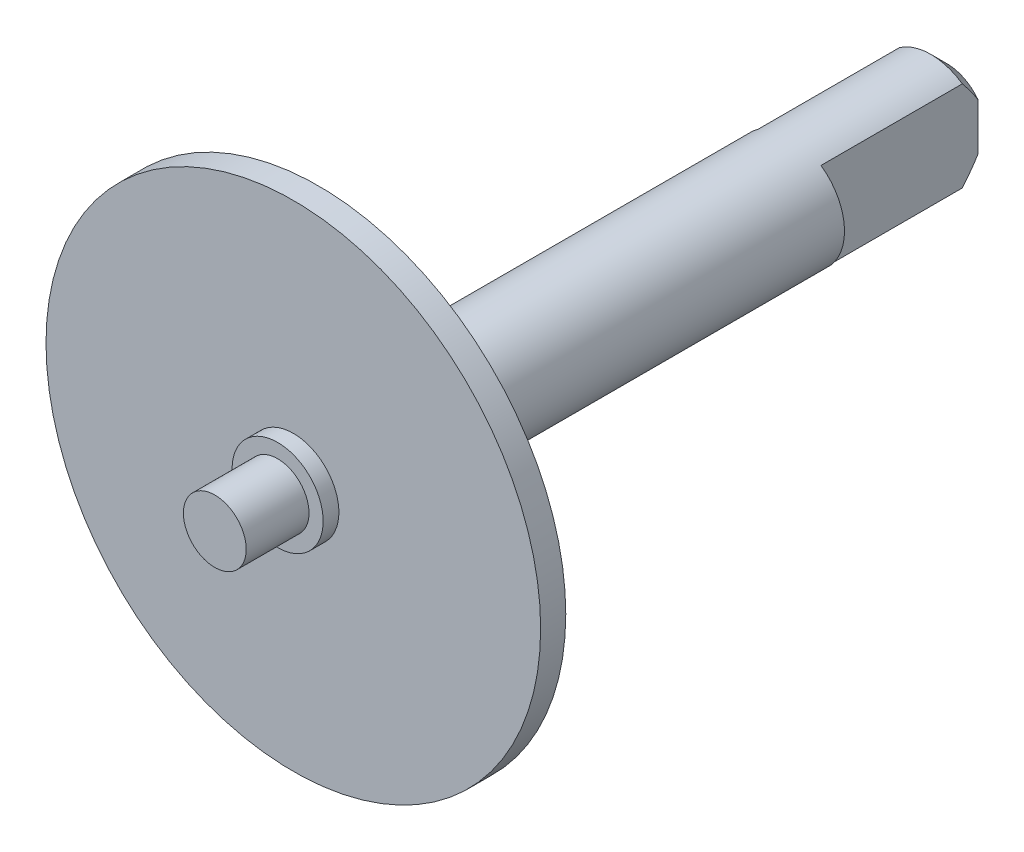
ISO-10303-21;
HEADER;
FILE_DESCRIPTION(('STEP AP214'),'2;1');
FILE_NAME('part.step','',(''),(''),'','','');
FILE_SCHEMA(('AUTOMOTIVE_DESIGN { 1 0 10303 214 1 1 1 1 }'));
ENDSEC;
DATA;
#1=APPLICATION_CONTEXT('core data for automotive mechanical design processes');
#2=APPLICATION_PROTOCOL_DEFINITION('international standard','automotive_design',2000,#1);
#3=PRODUCT_CONTEXT('',#1,'mechanical');
#4=PRODUCT('Part','Part','',(#3));
#5=PRODUCT_RELATED_PRODUCT_CATEGORY('part','',(#4));
#6=PRODUCT_DEFINITION_FORMATION('','',#4);
#7=PRODUCT_DEFINITION_CONTEXT('part definition',#1,'design');
#8=PRODUCT_DEFINITION('design','',#6,#7);
#9=PRODUCT_DEFINITION_SHAPE('','',#8);
#10=(LENGTH_UNIT() NAMED_UNIT(*) SI_UNIT(.MILLI.,.METRE.));
#11=(NAMED_UNIT(*) PLANE_ANGLE_UNIT() SI_UNIT($,.RADIAN.));
#12=(NAMED_UNIT(*) SI_UNIT($,.STERADIAN.) SOLID_ANGLE_UNIT());
#13=UNCERTAINTY_MEASURE_WITH_UNIT(LENGTH_MEASURE(1.E-05),#10,'distance_accuracy_value','');
#14=(GEOMETRIC_REPRESENTATION_CONTEXT(3) GLOBAL_UNCERTAINTY_ASSIGNED_CONTEXT((#13)) GLOBAL_UNIT_ASSIGNED_CONTEXT((#10,
#11,#12)) REPRESENTATION_CONTEXT('',''));
#15=CARTESIAN_POINT('',(0.,0.,0.));
#16=DIRECTION('',(0.,0.,1.));
#17=DIRECTION('',(1.,0.,0.));
#18=AXIS2_PLACEMENT_3D('',#15,#16,#17);
#19=CARTESIAN_POINT('',(10.,0.,-15.));
#20=DIRECTION('',(0.,0.,1.));
#21=DIRECTION('',(1.,0.,0.));
#22=AXIS2_PLACEMENT_3D('',#19,#20,#21);
#23=CYLINDRICAL_SURFACE('',#22,1.75);
#24=CARTESIAN_POINT('',(10.,0.,2.5));
#25=DIRECTION('',(0.,0.,1.));
#26=DIRECTION('',(1.,0.,0.));
#27=AXIS2_PLACEMENT_3D('',#24,#25,#26);
#28=CIRCLE('',#27,1.75);
#29=CARTESIAN_POINT('',(11.75,0.,2.5));
#30=VERTEX_POINT('',#29);
#31=EDGE_CURVE('E127',#30,#30,#28,.T.);
#32=ORIENTED_EDGE('',*,*,#31,.F.);
#33=EDGE_LOOP('',(#32));
#34=FACE_BOUND('',#33,.T.);
#35=DIRECTION('',(0.,0.,1.));
#36=VECTOR('',#35,1.);
#37=CARTESIAN_POINT('',(9.00000000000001,-1.43614066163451,-15.));
#38=LINE('',#37,#36);
#39=CARTESIAN_POINT('',(9.00000000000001,-1.43614066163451,-10.));
#40=VERTEX_POINT('',#39);
#41=CARTESIAN_POINT('',(9.00000000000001,-1.43614066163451,-14.5));
#42=VERTEX_POINT('',#41);
#43=EDGE_CURVE('E125',#40,#42,#38,.F.);
#44=ORIENTED_EDGE('',*,*,#43,.T.);
#45=CARTESIAN_POINT('',(10.,0.,-14.5));
#46=DIRECTION('',(0.,0.,1.));
#47=DIRECTION('',(1.,0.,0.));
#48=AXIS2_PLACEMENT_3D('',#45,#46,#47);
#49=CIRCLE('',#48,1.75);
#50=CARTESIAN_POINT('',(11.,-1.43614066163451,-14.5));
#51=VERTEX_POINT('',#50);
#52=EDGE_CURVE('E134',#42,#51,#49,.T.);
#53=ORIENTED_EDGE('',*,*,#52,.T.);
#54=DIRECTION('',(0.,0.,1.));
#55=VECTOR('',#54,1.);
#56=CARTESIAN_POINT('',(11.,-1.43614066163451,-15.));
#57=LINE('',#56,#55);
#58=CARTESIAN_POINT('',(11.,-1.43614066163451,-10.));
#59=VERTEX_POINT('',#58);
#60=EDGE_CURVE('E95',#51,#59,#57,.T.);
#61=ORIENTED_EDGE('',*,*,#60,.T.);
#62=CARTESIAN_POINT('',(10.,0.,-10.));
#63=DIRECTION('',(0.,0.,-1.));
#64=DIRECTION('',(-1.,0.,0.));
#65=AXIS2_PLACEMENT_3D('',#62,#63,#64);
#66=CIRCLE('',#65,1.75);
#67=CARTESIAN_POINT('',(11.,1.43614066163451,-10.));
#68=VERTEX_POINT('',#67);
#69=EDGE_CURVE('E87',#59,#68,#66,.F.);
#70=ORIENTED_EDGE('',*,*,#69,.T.);
#71=DIRECTION('',(0.,0.,1.));
#72=VECTOR('',#71,1.);
#73=CARTESIAN_POINT('',(11.,1.43614066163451,-15.));
#74=LINE('',#73,#72);
#75=CARTESIAN_POINT('',(11.,1.43614066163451,-14.5));
#76=VERTEX_POINT('',#75);
#77=EDGE_CURVE('E91',#68,#76,#74,.F.);
#78=ORIENTED_EDGE('',*,*,#77,.T.);
#79=CARTESIAN_POINT('',(10.,0.,-14.5));
#80=DIRECTION('',(0.,0.,1.));
#81=DIRECTION('',(1.,0.,0.));
#82=AXIS2_PLACEMENT_3D('',#79,#80,#81);
#83=CIRCLE('',#82,1.75);
#84=CARTESIAN_POINT('',(9.00000000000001,1.43614066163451,-14.5));
#85=VERTEX_POINT('',#84);
#86=EDGE_CURVE('E132',#76,#85,#83,.T.);
#87=ORIENTED_EDGE('',*,*,#86,.T.);
#88=DIRECTION('',(0.,0.,1.));
#89=VECTOR('',#88,1.);
#90=CARTESIAN_POINT('',(9.00000000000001,1.43614066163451,-15.));
#91=LINE('',#90,#89);
#92=CARTESIAN_POINT('',(9.00000000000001,1.43614066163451,-10.));
#93=VERTEX_POINT('',#92);
#94=EDGE_CURVE('E108',#85,#93,#91,.T.);
#95=ORIENTED_EDGE('',*,*,#94,.T.);
#96=CARTESIAN_POINT('',(10.,0.,-10.));
#97=DIRECTION('',(0.,0.,-1.));
#98=DIRECTION('',(-1.,0.,0.));
#99=AXIS2_PLACEMENT_3D('',#96,#97,#98);
#100=CIRCLE('',#99,1.75);
#101=EDGE_CURVE('E99',#93,#40,#100,.F.);
#102=ORIENTED_EDGE('',*,*,#101,.T.);
#103=EDGE_LOOP('',(#44,#53,#61,#70,#78,#87,#95,#102));
#104=FACE_BOUND('',#103,.T.);
#105=ADVANCED_FACE('F31',(#34,#104),#23,.T.);
#106=CARTESIAN_POINT('',(10.,0.,-15.));
#107=DIRECTION('',(0.,0.,1.));
#108=DIRECTION('',(1.,0.,0.));
#109=AXIS2_PLACEMENT_3D('',#106,#107,#108);
#110=PLANE('',#109);
#111=DIRECTION('',(0.,1.,0.));
#112=VECTOR('',#111,1.);
#113=CARTESIAN_POINT('',(11.,0.,-15.));
#114=LINE('',#113,#112);
#115=CARTESIAN_POINT('',(11.,-0.749999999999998,-15.));
#116=VERTEX_POINT('',#115);
#117=CARTESIAN_POINT('',(11.,0.749999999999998,-15.));
#118=VERTEX_POINT('',#117);
#119=EDGE_CURVE('E121',#116,#118,#114,.T.);
#120=ORIENTED_EDGE('',*,*,#119,.F.);
#121=CARTESIAN_POINT('',(10.,0.,-15.));
#122=DIRECTION('',(0.,0.,1.));
#123=DIRECTION('',(1.,0.,0.));
#124=AXIS2_PLACEMENT_3D('',#121,#122,#123);
#125=CIRCLE('',#124,1.25);
#126=CARTESIAN_POINT('',(9.00000000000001,-0.749999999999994,-15.));
#127=VERTEX_POINT('',#126);
#128=EDGE_CURVE('E50',#116,#127,#125,.F.);
#129=ORIENTED_EDGE('',*,*,#128,.T.);
#130=DIRECTION('',(0.,-1.,0.));
#131=VECTOR('',#130,1.);
#132=CARTESIAN_POINT('',(9.00000000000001,22.7331668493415,-15.));
#133=LINE('',#132,#131);
#134=CARTESIAN_POINT('',(9.00000000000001,0.749999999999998,-15.));
#135=VERTEX_POINT('',#134);
#136=EDGE_CURVE('E100',#135,#127,#133,.T.);
#137=ORIENTED_EDGE('',*,*,#136,.F.);
#138=CARTESIAN_POINT('',(10.,0.,-15.));
#139=DIRECTION('',(0.,0.,1.));
#140=DIRECTION('',(1.,0.,0.));
#141=AXIS2_PLACEMENT_3D('',#138,#139,#140);
#142=CIRCLE('',#141,1.25);
#143=EDGE_CURVE('E179',#135,#118,#142,.F.);
#144=ORIENTED_EDGE('',*,*,#143,.T.);
#145=EDGE_LOOP('',(#120,#129,#137,#144));
#146=FACE_BOUND('',#145,.T.);
#147=ADVANCED_FACE('F171',(#146),#110,.F.);
#148=CARTESIAN_POINT('',(11.,22.7331668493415,-15.));
#149=DIRECTION('',(1.,0.,0.));
#150=DIRECTION('',(0.,0.,-1.));
#151=AXIS2_PLACEMENT_3D('',#148,#149,#150);
#152=PLANE('',#151);
#153=ORIENTED_EDGE('',*,*,#60,.F.);
#154=CARTESIAN_POINT('',(11.,-1.43614066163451,-14.5));
#155=CARTESIAN_POINT('',(11.,-1.38137120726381,-14.5449012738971));
#156=CARTESIAN_POINT('',(11.,-1.32622333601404,-14.589360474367));
#157=CARTESIAN_POINT('',(11.,-1.21491846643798,-14.676848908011));
#158=CARTESIAN_POINT('',(11.,-1.15876280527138,-14.7198798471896));
#159=CARTESIAN_POINT('',(11.,-1.04502076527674,-14.8041056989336));
#160=CARTESIAN_POINT('',(11.,-0.987433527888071,-14.8452994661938));
#161=CARTESIAN_POINT('',(11.,-0.899618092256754,-14.9050637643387));
#162=CARTESIAN_POINT('',(11.,-0.870088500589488,-14.9246589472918));
#163=CARTESIAN_POINT('',(11.,-0.810476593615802,-14.9630051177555));
#164=CARTESIAN_POINT('',(11.,-0.780394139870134,-14.9817558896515));
#165=CARTESIAN_POINT('',(11.,-0.749999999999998,-15.));
#166=B_SPLINE_CURVE_WITH_KNOTS('',3,(#154,#155,#156,#157,#158,#159,#160,#161,#162,#163,#164,
#165),.UNSPECIFIED.,.F.,.F.,(4,2,2,2,2,4),(0.,0.212482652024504,0.424701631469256,
0.63705111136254,0.743357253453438,0.849690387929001),.UNSPECIFIED.);
#167=EDGE_CURVE('E142',#51,#116,#166,.T.);
#168=ORIENTED_EDGE('',*,*,#167,.T.);
#169=ORIENTED_EDGE('',*,*,#119,.T.);
#170=CARTESIAN_POINT('',(11.,0.749999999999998,-15.));
#171=CARTESIAN_POINT('',(11.,0.780394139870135,-14.9817558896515));
#172=CARTESIAN_POINT('',(11.,0.810476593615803,-14.9630051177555));
#173=CARTESIAN_POINT('',(11.,0.870088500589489,-14.9246589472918));
#174=CARTESIAN_POINT('',(11.,0.899618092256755,-14.9050637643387));
#175=CARTESIAN_POINT('',(11.,0.987433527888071,-14.8452994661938));
#176=CARTESIAN_POINT('',(11.,1.04502076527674,-14.8041056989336));
#177=CARTESIAN_POINT('',(11.,1.15876280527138,-14.7198798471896));
#178=CARTESIAN_POINT('',(11.,1.21491846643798,-14.676848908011));
#179=CARTESIAN_POINT('',(11.,1.32622333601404,-14.589360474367));
#180=CARTESIAN_POINT('',(11.,1.3813712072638,-14.5449012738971));
#181=CARTESIAN_POINT('',(11.,1.43614066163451,-14.5));
#182=B_SPLINE_CURVE_WITH_KNOTS('',3,(#170,#171,#172,#173,#174,#175,#176,#177,#178,#179,#180,
#181),.UNSPECIFIED.,.F.,.F.,(4,2,2,2,2,4),(0.,0.106333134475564,0.212639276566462,
0.424988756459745,0.637207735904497,0.849690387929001),.UNSPECIFIED.);
#183=EDGE_CURVE('E107',#118,#76,#182,.T.);
#184=ORIENTED_EDGE('',*,*,#183,.T.);
#185=ORIENTED_EDGE('',*,*,#77,.F.);
#186=DIRECTION('',(0.,-1.,0.));
#187=VECTOR('',#186,1.);
#188=CARTESIAN_POINT('',(11.,22.7331668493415,-10.));
#189=LINE('',#188,#187);
#190=EDGE_CURVE('E104',#68,#59,#189,.T.);
#191=ORIENTED_EDGE('',*,*,#190,.T.);
#192=EDGE_LOOP('',(#153,#168,#169,#184,#185,#191));
#193=FACE_BOUND('',#192,.T.);
#194=ADVANCED_FACE('F103',(#193),#152,.T.);
#195=CARTESIAN_POINT('',(11.,22.7331668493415,-10.));
#196=DIRECTION('',(0.,0.,-1.));
#197=DIRECTION('',(-1.,0.,0.));
#198=AXIS2_PLACEMENT_3D('',#195,#196,#197);
#199=PLANE('',#198);
#200=ORIENTED_EDGE('',*,*,#69,.F.);
#201=ORIENTED_EDGE('',*,*,#190,.F.);
#202=EDGE_LOOP('',(#200,#201));
#203=FACE_BOUND('',#202,.T.);
#204=ADVANCED_FACE('F110',(#203),#199,.T.);
#205=CARTESIAN_POINT('',(9.00000000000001,22.7331668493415,-10.));
#206=DIRECTION('',(0.,0.,-1.));
#207=DIRECTION('',(-1.,0.,0.));
#208=AXIS2_PLACEMENT_3D('',#205,#206,#207);
#209=PLANE('',#208);
#210=DIRECTION('',(0.,-1.,0.));
#211=VECTOR('',#210,1.);
#212=CARTESIAN_POINT('',(9.00000000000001,22.7331668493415,-10.));
#213=LINE('',#212,#211);
#214=EDGE_CURVE('E111',#93,#40,#213,.T.);
#215=ORIENTED_EDGE('',*,*,#214,.T.);
#216=ORIENTED_EDGE('',*,*,#101,.F.);
#217=EDGE_LOOP('',(#215,#216));
#218=FACE_BOUND('',#217,.T.);
#219=ADVANCED_FACE('F167',(#218),#209,.T.);
#220=CARTESIAN_POINT('',(9.00000000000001,22.7331668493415,-15.));
#221=DIRECTION('',(-1.,0.,0.));
#222=DIRECTION('',(0.,0.,1.));
#223=AXIS2_PLACEMENT_3D('',#220,#221,#222);
#224=PLANE('',#223);
#225=ORIENTED_EDGE('',*,*,#136,.T.);
#226=CARTESIAN_POINT('',(9.,-0.749999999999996,-15.));
#227=CARTESIAN_POINT('',(9.00000000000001,-0.780394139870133,-14.9817558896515));
#228=CARTESIAN_POINT('',(9.00000000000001,-0.810476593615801,-14.9630051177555));
#229=CARTESIAN_POINT('',(9.00000000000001,-0.870088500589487,-14.9246589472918));
#230=CARTESIAN_POINT('',(9.00000000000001,-0.899618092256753,-14.9050637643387));
#231=CARTESIAN_POINT('',(9.00000000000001,-0.98743352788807,-14.8452994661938));
#232=CARTESIAN_POINT('',(9.00000000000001,-1.04502076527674,-14.8041056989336));
#233=CARTESIAN_POINT('',(9.00000000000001,-1.15876280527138,-14.7198798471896));
#234=CARTESIAN_POINT('',(9.00000000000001,-1.21491846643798,-14.676848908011));
#235=CARTESIAN_POINT('',(9.00000000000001,-1.32622333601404,-14.589360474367));
#236=CARTESIAN_POINT('',(9.00000000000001,-1.38137120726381,-14.5449012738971));
#237=CARTESIAN_POINT('',(9.00000000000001,-1.43614066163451,-14.5));
#238=B_SPLINE_CURVE_WITH_KNOTS('',3,(#226,#227,#228,#229,#230,#231,#232,#233,#234,#235,#236,
#237),.UNSPECIFIED.,.F.,.F.,(4,2,2,2,2,4),(0.,0.106333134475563,0.212639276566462,
0.424988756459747,0.637207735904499,0.849690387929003),.UNSPECIFIED.);
#239=EDGE_CURVE('E11',#127,#42,#238,.T.);
#240=ORIENTED_EDGE('',*,*,#239,.T.);
#241=ORIENTED_EDGE('',*,*,#43,.F.);
#242=ORIENTED_EDGE('',*,*,#214,.F.);
#243=ORIENTED_EDGE('',*,*,#94,.F.);
#244=CARTESIAN_POINT('',(9.00000000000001,1.43614066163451,-14.5));
#245=CARTESIAN_POINT('',(9.00000000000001,1.38137120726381,-14.5449012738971));
#246=CARTESIAN_POINT('',(9.00000000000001,1.32622333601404,-14.589360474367));
#247=CARTESIAN_POINT('',(9.00000000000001,1.21491846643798,-14.676848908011));
#248=CARTESIAN_POINT('',(9.00000000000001,1.15876280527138,-14.7198798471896));
#249=CARTESIAN_POINT('',(9.00000000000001,1.04502076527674,-14.8041056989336));
#250=CARTESIAN_POINT('',(9.00000000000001,0.987433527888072,-14.8452994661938));
#251=CARTESIAN_POINT('',(9.00000000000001,0.899618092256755,-14.9050637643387));
#252=CARTESIAN_POINT('',(9.00000000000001,0.870088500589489,-14.9246589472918));
#253=CARTESIAN_POINT('',(9.00000000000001,0.810476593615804,-14.9630051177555));
#254=CARTESIAN_POINT('',(9.00000000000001,0.780394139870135,-14.9817558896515));
#255=CARTESIAN_POINT('',(9.00000000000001,0.749999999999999,-15.));
#256=B_SPLINE_CURVE_WITH_KNOTS('',3,(#244,#245,#246,#247,#248,#249,#250,#251,#252,#253,#254,
#255),.UNSPECIFIED.,.F.,.F.,(4,2,2,2,2,4),(0.,0.212482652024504,0.424701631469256,
0.637051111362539,0.743357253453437,0.849690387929),.UNSPECIFIED.);
#257=EDGE_CURVE('E43',#85,#135,#256,.T.);
#258=ORIENTED_EDGE('',*,*,#257,.T.);
#259=EDGE_LOOP('',(#225,#240,#241,#242,#243,#258));
#260=FACE_BOUND('',#259,.T.);
#261=ADVANCED_FACE('F163',(#260),#224,.T.);
#262=CARTESIAN_POINT('',(10.,0.,-14.5));
#263=DIRECTION('',(0.,0.,1.));
#264=DIRECTION('',(1.,0.,0.));
#265=AXIS2_PLACEMENT_3D('',#262,#263,#264);
#266=CONICAL_SURFACE('',#265,1.75,0.78539816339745);
#267=ORIENTED_EDGE('',*,*,#239,.F.);
#268=ORIENTED_EDGE('',*,*,#128,.F.);
#269=ORIENTED_EDGE('',*,*,#167,.F.);
#270=ORIENTED_EDGE('',*,*,#52,.F.);
#271=EDGE_LOOP('',(#267,#268,#269,#270));
#272=FACE_BOUND('',#271,.T.);
#273=ADVANCED_FACE('F154',(#272),#266,.T.);
#274=CARTESIAN_POINT('',(10.,0.,-14.5));
#275=DIRECTION('',(0.,0.,1.));
#276=DIRECTION('',(1.,0.,0.));
#277=AXIS2_PLACEMENT_3D('',#274,#275,#276);
#278=CONICAL_SURFACE('',#277,1.75,0.78539816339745);
#279=ORIENTED_EDGE('',*,*,#183,.F.);
#280=ORIENTED_EDGE('',*,*,#143,.F.);
#281=ORIENTED_EDGE('',*,*,#257,.F.);
#282=ORIENTED_EDGE('',*,*,#86,.F.);
#283=EDGE_LOOP('',(#279,#280,#281,#282));
#284=FACE_BOUND('',#283,.T.);
#285=ADVANCED_FACE('F149',(#284),#278,.T.);
#286=CARTESIAN_POINT('',(10.,0.,2.5));
#287=DIRECTION('',(0.,0.,1.));
#288=DIRECTION('',(1.,0.,0.));
#289=AXIS2_PLACEMENT_3D('',#286,#287,#288);
#290=PLANE('',#289);
#291=ORIENTED_EDGE('',*,*,#31,.T.);
#292=EDGE_LOOP('',(#291));
#293=FACE_BOUND('',#292,.T.);
#294=CARTESIAN_POINT('',(10.,0.,2.5));
#295=DIRECTION('',(0.,0.,-1.));
#296=DIRECTION('',(-1.,0.,0.));
#297=AXIS2_PLACEMENT_3D('',#294,#295,#296);
#298=CIRCLE('',#297,2.05);
#299=CARTESIAN_POINT('',(7.95,0.,2.5));
#300=VERTEX_POINT('',#299);
#301=EDGE_CURVE('E112',#300,#300,#298,.T.);
#302=ORIENTED_EDGE('',*,*,#301,.T.);
#303=EDGE_LOOP('',(#302));
#304=FACE_BOUND('',#303,.T.);
#305=ADVANCED_FACE('F153',(#293,#304),#290,.F.);
#306=CARTESIAN_POINT('',(10.,0.,2.5));
#307=DIRECTION('',(0.,0.,-1.));
#308=DIRECTION('',(-1.,0.,0.));
#309=AXIS2_PLACEMENT_3D('',#306,#307,#308);
#310=CYLINDRICAL_SURFACE('',#309,2.05);
#311=ORIENTED_EDGE('',*,*,#301,.F.);
#312=EDGE_LOOP('',(#311));
#313=FACE_BOUND('',#312,.T.);
#314=CARTESIAN_POINT('',(10.,0.,5.));
#315=DIRECTION('',(0.,0.,-1.));
#316=DIRECTION('',(-1.,0.,0.));
#317=AXIS2_PLACEMENT_3D('',#314,#315,#316);
#318=CIRCLE('',#317,2.05);
#319=CARTESIAN_POINT('',(7.95,0.,5.));
#320=VERTEX_POINT('',#319);
#321=EDGE_CURVE('E117',#320,#320,#318,.T.);
#322=ORIENTED_EDGE('',*,*,#321,.T.);
#323=EDGE_LOOP('',(#322));
#324=FACE_BOUND('',#323,.T.);
#325=ADVANCED_FACE('F201',(#313,#324),#310,.T.);
#326=CARTESIAN_POINT('',(12.05,0.,5.));
#327=DIRECTION('',(0.,0.,1.));
#328=DIRECTION('',(1.,0.,0.));
#329=AXIS2_PLACEMENT_3D('',#326,#327,#328);
#330=PLANE('',#329);
#331=ORIENTED_EDGE('',*,*,#321,.F.);
#332=EDGE_LOOP('',(#331));
#333=FACE_BOUND('',#332,.T.);
#334=CARTESIAN_POINT('',(10.,0.,5.));
#335=DIRECTION('',(0.,0.,-1.));
#336=DIRECTION('',(-1.,0.,0.));
#337=AXIS2_PLACEMENT_3D('',#334,#335,#336);
#338=CIRCLE('',#337,7.875);
#339=CARTESIAN_POINT('',(2.12500000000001,0.,5.));
#340=VERTEX_POINT('',#339);
#341=EDGE_CURVE('E339',#340,#340,#338,.T.);
#342=ORIENTED_EDGE('',*,*,#341,.T.);
#343=EDGE_LOOP('',(#342));
#344=FACE_BOUND('',#343,.T.);
#345=ADVANCED_FACE('F208',(#333,#344),#330,.F.);
#346=CARTESIAN_POINT('',(10.,0.,2.5));
#347=DIRECTION('',(0.,0.,-1.));
#348=DIRECTION('',(-1.,0.,0.));
#349=AXIS2_PLACEMENT_3D('',#346,#347,#348);
#350=CYLINDRICAL_SURFACE('',#349,7.875);
#351=ORIENTED_EDGE('',*,*,#341,.F.);
#352=EDGE_LOOP('',(#351));
#353=FACE_BOUND('',#352,.T.);
#354=CARTESIAN_POINT('',(10.,0.,5.8));
#355=DIRECTION('',(0.,0.,-1.));
#356=DIRECTION('',(-1.,0.,0.));
#357=AXIS2_PLACEMENT_3D('',#354,#355,#356);
#358=CIRCLE('',#357,7.875);
#359=CARTESIAN_POINT('',(2.12500000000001,0.,5.80000000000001));
#360=VERTEX_POINT('',#359);
#361=EDGE_CURVE('E336',#360,#360,#358,.T.);
#362=ORIENTED_EDGE('',*,*,#361,.T.);
#363=EDGE_LOOP('',(#362));
#364=FACE_BOUND('',#363,.T.);
#365=ADVANCED_FACE('F215',(#353,#364),#350,.T.);
#366=CARTESIAN_POINT('',(17.875,0.,5.8));
#367=DIRECTION('',(0.,0.,-1.));
#368=DIRECTION('',(-1.,0.,0.));
#369=AXIS2_PLACEMENT_3D('',#366,#367,#368);
#370=PLANE('',#369);
#371=ORIENTED_EDGE('',*,*,#361,.F.);
#372=EDGE_LOOP('',(#371));
#373=FACE_BOUND('',#372,.T.);
#374=CARTESIAN_POINT('',(10.,0.,5.8));
#375=DIRECTION('',(0.,0.,-1.));
#376=DIRECTION('',(-1.,0.,0.));
#377=AXIS2_PLACEMENT_3D('',#374,#375,#376);
#378=CIRCLE('',#377,1.45);
#379=CARTESIAN_POINT('',(8.55000000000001,0.,5.8));
#380=VERTEX_POINT('',#379);
#381=EDGE_CURVE('E333',#380,#380,#378,.T.);
#382=ORIENTED_EDGE('',*,*,#381,.T.);
#383=EDGE_LOOP('',(#382));
#384=FACE_BOUND('',#383,.T.);
#385=ADVANCED_FACE('F223',(#373,#384),#370,.F.);
#386=CARTESIAN_POINT('',(10.,0.,2.5));
#387=DIRECTION('',(0.,0.,-1.));
#388=DIRECTION('',(-1.,0.,0.));
#389=AXIS2_PLACEMENT_3D('',#386,#387,#388);
#390=CYLINDRICAL_SURFACE('',#389,1.45);
#391=ORIENTED_EDGE('',*,*,#381,.F.);
#392=EDGE_LOOP('',(#391));
#393=FACE_BOUND('',#392,.T.);
#394=CARTESIAN_POINT('',(10.,0.,6.3));
#395=DIRECTION('',(0.,0.,-1.));
#396=DIRECTION('',(-1.,0.,0.));
#397=AXIS2_PLACEMENT_3D('',#394,#395,#396);
#398=CIRCLE('',#397,1.45);
#399=CARTESIAN_POINT('',(8.55000000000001,0.,6.3));
#400=VERTEX_POINT('',#399);
#401=EDGE_CURVE('E328',#400,#400,#398,.T.);
#402=ORIENTED_EDGE('',*,*,#401,.T.);
#403=EDGE_LOOP('',(#402));
#404=FACE_BOUND('',#403,.T.);
#405=ADVANCED_FACE('F231',(#393,#404),#390,.T.);
#406=CARTESIAN_POINT('',(11.45,0.,6.3));
#407=DIRECTION('',(0.,0.,-1.));
#408=DIRECTION('',(-1.,0.,0.));
#409=AXIS2_PLACEMENT_3D('',#406,#407,#408);
#410=PLANE('',#409);
#411=ORIENTED_EDGE('',*,*,#401,.F.);
#412=EDGE_LOOP('',(#411));
#413=FACE_BOUND('',#412,.T.);
#414=CARTESIAN_POINT('',(10.,0.,6.3));
#415=DIRECTION('',(0.,0.,-1.));
#416=DIRECTION('',(-1.,0.,0.));
#417=AXIS2_PLACEMENT_3D('',#414,#415,#416);
#418=CIRCLE('',#417,1.);
#419=CARTESIAN_POINT('',(9.00000000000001,0.,6.3));
#420=VERTEX_POINT('',#419);
#421=EDGE_CURVE('E325',#420,#420,#418,.T.);
#422=ORIENTED_EDGE('',*,*,#421,.T.);
#423=EDGE_LOOP('',(#422));
#424=FACE_BOUND('',#423,.T.);
#425=ADVANCED_FACE('F239',(#413,#424),#410,.F.);
#426=CARTESIAN_POINT('',(10.,0.,2.5));
#427=DIRECTION('',(0.,0.,-1.));
#428=DIRECTION('',(-1.,0.,0.));
#429=AXIS2_PLACEMENT_3D('',#426,#427,#428);
#430=CYLINDRICAL_SURFACE('',#429,0.999999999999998);
#431=ORIENTED_EDGE('',*,*,#421,.F.);
#432=EDGE_LOOP('',(#431));
#433=FACE_BOUND('',#432,.T.);
#434=CARTESIAN_POINT('',(10.,0.,8.3));
#435=DIRECTION('',(0.,0.,-1.));
#436=DIRECTION('',(-1.,0.,0.));
#437=AXIS2_PLACEMENT_3D('',#434,#435,#436);
#438=CIRCLE('',#437,0.999999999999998);
#439=CARTESIAN_POINT('',(9.00000000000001,0.,8.3));
#440=VERTEX_POINT('',#439);
#441=EDGE_CURVE('E323',#440,#440,#438,.T.);
#442=ORIENTED_EDGE('',*,*,#441,.T.);
#443=EDGE_LOOP('',(#442));
#444=FACE_BOUND('',#443,.T.);
#445=ADVANCED_FACE('F247',(#433,#444),#430,.T.);
#446=CARTESIAN_POINT('',(11.,0.,8.3));
#447=DIRECTION('',(0.,0.,-1.));
#448=DIRECTION('',(-1.,0.,0.));
#449=AXIS2_PLACEMENT_3D('',#446,#447,#448);
#450=PLANE('',#449);
#451=ORIENTED_EDGE('',*,*,#441,.F.);
#452=EDGE_LOOP('',(#451));
#453=FACE_BOUND('',#452,.T.);
#454=ADVANCED_FACE('F255',(#453),#450,.F.);
#455=CLOSED_SHELL('',(#105,#147,#194,#204,#219,#261,#273,#285,#305,#325,#345,#365,#385,#405,
#425,#445,#454));
#456=MANIFOLD_SOLID_BREP('B2',#455);
#457=ADVANCED_BREP_SHAPE_REPRESENTATION('',(#18,#456),#14);
#458=SHAPE_DEFINITION_REPRESENTATION(#9,#457);
ENDSEC;
END-ISO-10303-21;
